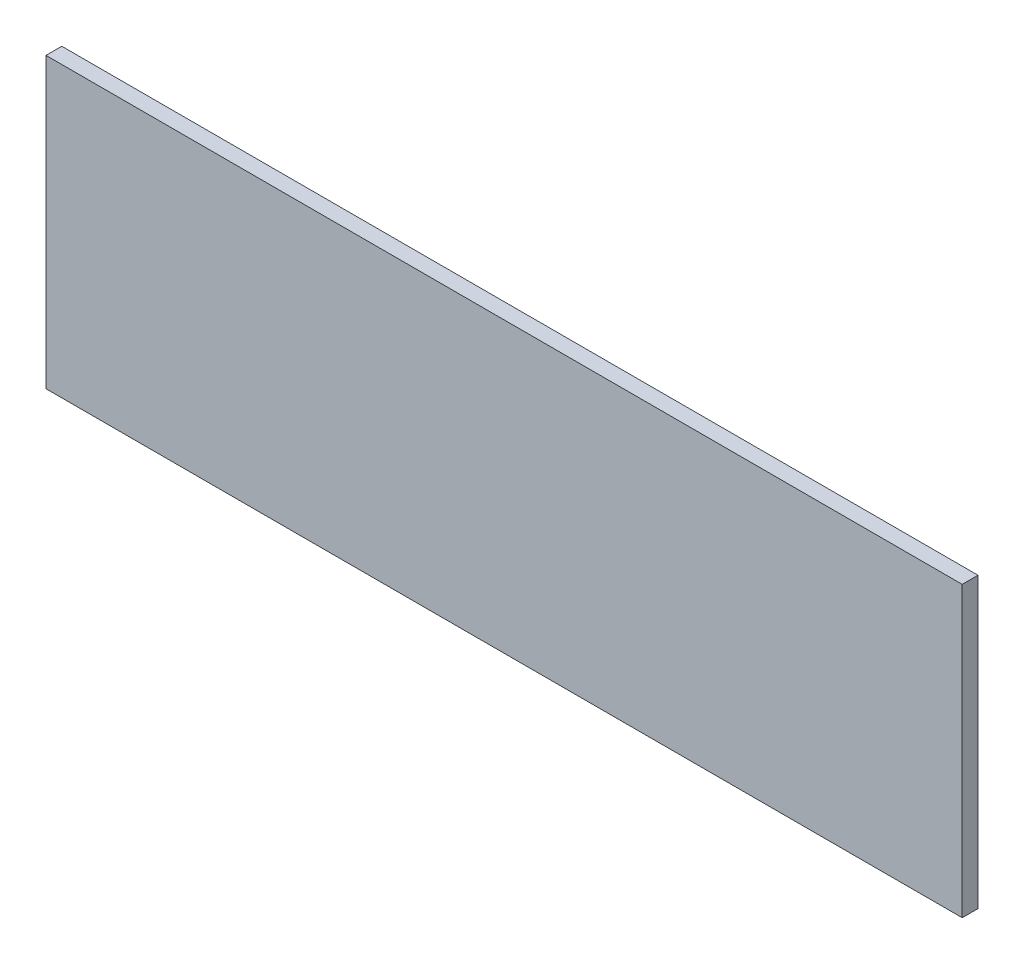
from build123d import *

# Parameters (mm, degrees)
ESQUISSE2_W             = 10
ESQUISSE2_H             = 182.78
BOSS_EXTRU_1_DEPTH      = 600
ESQUISSE3_W             = 10
ESQUISSE3_H             = 182.78
ENL_V_MAT_EXTRU_1_DEPTH = 10


with BuildPart() as part:
    # Esquisse2 → Boss.-Extru.1 (new body)
    with BuildSketch(Plane(origin=(0, 0, 0), x_dir=(0, 0, -1), z_dir=(1, 0, 0))):
        with Locations((-407.300331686, -226.881079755)):
            Rectangle(ESQUISSE2_W, ESQUISSE2_H)
    extrude(amount=BOSS_EXTRU_1_DEPTH)

    # Esquisse3 → Enl_v. mat.-Extru.1 (cut)
    with BuildSketch(Plane.XY.offset(412.300331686)):
        with Locations((5, -226.881079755)):
            Rectangle(ESQUISSE3_W, ESQUISSE3_H)
        with Locations((595, -226.881079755)):
            Rectangle(ESQUISSE3_W, ESQUISSE3_H)
    extrude(amount=-ENL_V_MAT_EXTRU_1_DEPTH, mode=Mode.SUBTRACT)


solid = part.part
